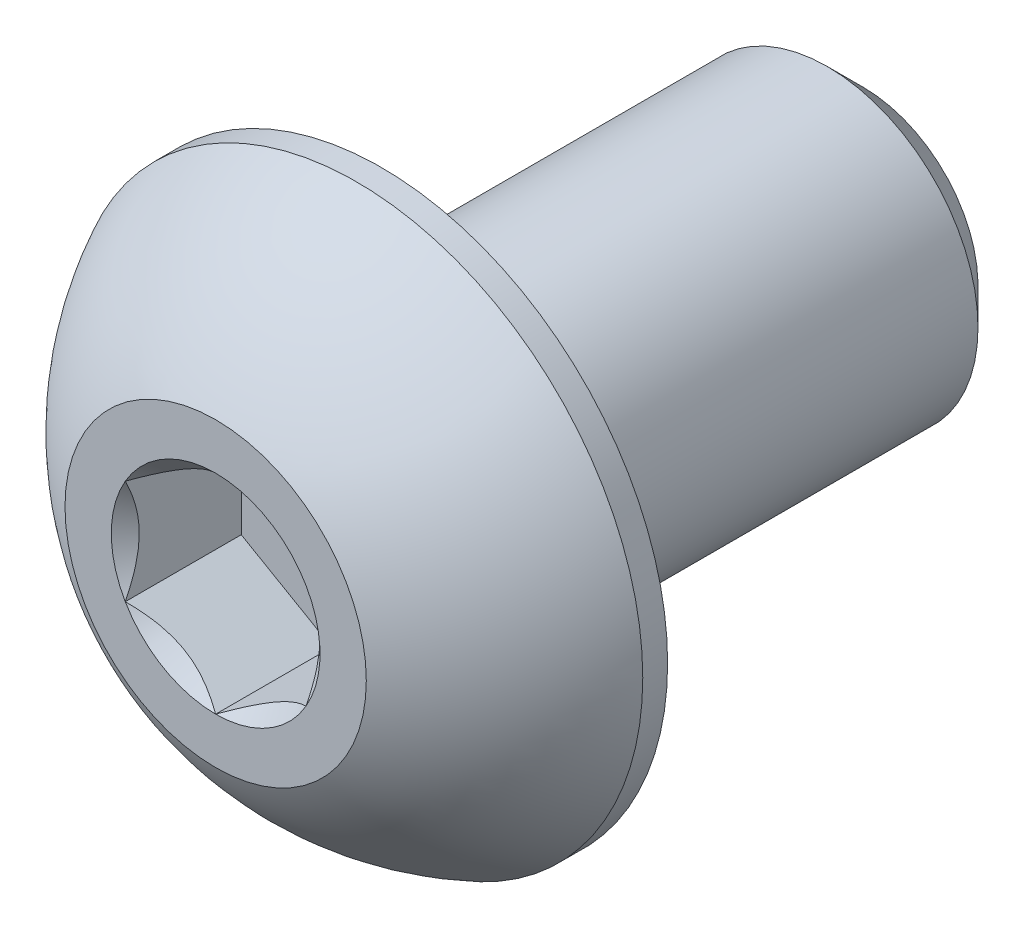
from build123d import *

# Parameters (mm, degrees)
SKETCH1_W          = 8
SKETCH1_H          = 2.5
CHAMFER1_SIZE      = 0.6
CUT_EXTRUDE2_DEPTH = 1.925


with BuildPart() as part:
    # Sketch1 → Revolve1 (revolve)
    with BuildSketch(Plane(origin=(0, 0, 0), x_dir=(0, 0, -1), z_dir=(1, 0, 0))):
        with Locations((6.75, 1.25)):
            Rectangle(SKETCH1_W, SKETCH1_H)
    revolve(axis=Axis((0, 0, -10.75), (0, 0, 1)))

    # Chamfer1
    chamfer1_edges = [part.edges().sort_by_distance(p)[0] for p in [
        (0, -2.5, -10.75),
    ]]
    chamfer(chamfer1_edges, length=CHAMFER1_SIZE)

    # Sketch7 → Revolve2 (revolve)
    with BuildSketch(Plane(origin=(0, 0, 0), x_dir=(0, 0, -1), z_dir=(1, 0, 0)), mode=Mode.PRIVATE) as revolve2_sk:
        with BuildLine():
            Line((2.3375, 4.75), (2.75, 4.75))
            Line((2.75, 4.75), (2.75, 0))
            Line((2.75, 0), (0, 0))
            Line((0, 0), (0, 2.5))
            ThreePointArc((0, 2.5), (0.991875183, 3.808753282), (2.3375, 4.75))
        make_face()
    revolve(revolve2_sk.sketch.rotate(Axis((0, 0, 0), (0, 0, -1)), 180), axis=Axis((0, 0, 0), (0, 0, -1)))

    # Sketch5 → Cut-Extrude2 (cut)
    with BuildSketch(Plane.XY):
        Polygon((1.5, -0.866025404), (1.5, 0.866025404), (0, 1.732050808), (-1.5, 0.866025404), (-1.5, -0.866025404), (0, -1.732050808), align=None)
    extrude(amount=-CUT_EXTRUDE2_DEPTH, mode=Mode.SUBTRACT)

    # Cut-Extrude3 cone 1 section (on through the dimple's axis) → Cut-Extrude3 (revolve, cut)
    with BuildSketch(Plane(origin=(0, 0, 0), x_dir=(0, -1, 0), z_dir=(1, 0, 0))):
        Polygon((0, 0), (1.732050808, 0), (0, 1.732050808), align=None)
    revolve(axis=Axis((0, 0, 0), (0, 0, -1)), mode=Mode.SUBTRACT)


solid = part.part
